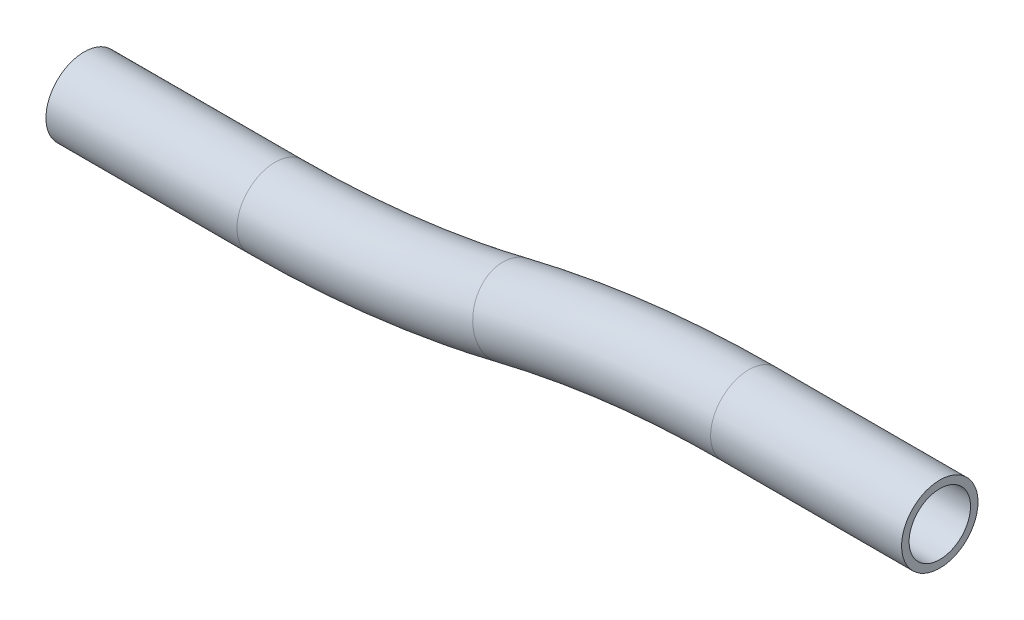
ISO-10303-21;
HEADER;
FILE_DESCRIPTION(('STEP AP214'),'2;1');
FILE_NAME('part.step','',(''),(''),'','','');
FILE_SCHEMA(('AUTOMOTIVE_DESIGN { 1 0 10303 214 1 1 1 1 }'));
ENDSEC;
DATA;
#1=APPLICATION_CONTEXT('core data for automotive mechanical design processes');
#2=APPLICATION_PROTOCOL_DEFINITION('international standard','automotive_design',2000,#1);
#3=PRODUCT_CONTEXT('',#1,'mechanical');
#4=PRODUCT('Part','Part','',(#3));
#5=PRODUCT_RELATED_PRODUCT_CATEGORY('part','',(#4));
#6=PRODUCT_DEFINITION_FORMATION('','',#4);
#7=PRODUCT_DEFINITION_CONTEXT('part definition',#1,'design');
#8=PRODUCT_DEFINITION('design','',#6,#7);
#9=PRODUCT_DEFINITION_SHAPE('','',#8);
#10=(LENGTH_UNIT() NAMED_UNIT(*) SI_UNIT(.MILLI.,.METRE.));
#11=(NAMED_UNIT(*) PLANE_ANGLE_UNIT() SI_UNIT($,.RADIAN.));
#12=(NAMED_UNIT(*) SI_UNIT($,.STERADIAN.) SOLID_ANGLE_UNIT());
#13=UNCERTAINTY_MEASURE_WITH_UNIT(LENGTH_MEASURE(1.E-05),#10,'distance_accuracy_value','');
#14=(GEOMETRIC_REPRESENTATION_CONTEXT(3) GLOBAL_UNCERTAINTY_ASSIGNED_CONTEXT((#13)) GLOBAL_UNIT_ASSIGNED_CONTEXT((#10,
#11,#12)) REPRESENTATION_CONTEXT('',''));
#15=CARTESIAN_POINT('',(0.,0.,0.));
#16=DIRECTION('',(0.,0.,1.));
#17=DIRECTION('',(1.,0.,0.));
#18=AXIS2_PLACEMENT_3D('',#15,#16,#17);
#19=CARTESIAN_POINT('',(110.49,9.4900533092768,0.));
#20=DIRECTION('',(1.,0.,0.));
#21=DIRECTION('',(0.,1.,0.));
#22=AXIS2_PLACEMENT_3D('',#19,#20,#21);
#23=CYLINDRICAL_SURFACE('',#22,6.35);
#24=CARTESIAN_POINT('',(110.49,9.4900533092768,0.));
#25=DIRECTION('',(1.,0.,0.));
#26=DIRECTION('',(0.,0.,-1.));
#27=AXIS2_PLACEMENT_3D('',#24,#25,#26);
#28=CIRCLE('',#27,6.35);
#29=CARTESIAN_POINT('',(110.49,15.8400533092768,0.));
#30=VERTEX_POINT('',#29);
#31=EDGE_CURVE('E39',#30,#30,#28,.T.);
#32=ORIENTED_EDGE('',*,*,#31,.T.);
#33=EDGE_LOOP('',(#32));
#34=FACE_BOUND('',#33,.T.);
#35=CARTESIAN_POINT('',(142.24,9.49005330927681,0.));
#36=DIRECTION('',(1.,0.,0.));
#37=DIRECTION('',(0.,0.,-1.));
#38=AXIS2_PLACEMENT_3D('',#35,#36,#37);
#39=CIRCLE('',#38,6.35);
#40=CARTESIAN_POINT('',(142.24,9.49005330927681,-6.35));
#41=VERTEX_POINT('',#40);
#42=EDGE_CURVE('E10',#41,#41,#39,.T.);
#43=ORIENTED_EDGE('',*,*,#42,.F.);
#44=EDGE_LOOP('',(#43));
#45=FACE_BOUND('',#44,.T.);
#46=ADVANCED_FACE('F29',(#34,#45),#23,.T.);
#47=CARTESIAN_POINT('',(110.49,9.4900533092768,0.));
#48=DIRECTION('',(1.,0.,0.));
#49=DIRECTION('',(0.,1.,0.));
#50=AXIS2_PLACEMENT_3D('',#47,#48,#49);
#51=CYLINDRICAL_SURFACE('',#50,5.1054);
#52=CARTESIAN_POINT('',(110.49,9.4900533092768,0.));
#53=DIRECTION('',(1.,0.,0.));
#54=DIRECTION('',(0.,0.,-1.));
#55=AXIS2_PLACEMENT_3D('',#52,#53,#54);
#56=CIRCLE('',#55,5.1054);
#57=CARTESIAN_POINT('',(110.49,14.5954533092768,0.));
#58=VERTEX_POINT('',#57);
#59=EDGE_CURVE('E43',#58,#58,#56,.T.);
#60=ORIENTED_EDGE('',*,*,#59,.F.);
#61=EDGE_LOOP('',(#60));
#62=FACE_BOUND('',#61,.T.);
#63=CARTESIAN_POINT('',(142.24,9.49005330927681,0.));
#64=DIRECTION('',(1.,0.,0.));
#65=DIRECTION('',(0.,0.,-1.));
#66=AXIS2_PLACEMENT_3D('',#63,#64,#65);
#67=CIRCLE('',#66,5.1054);
#68=CARTESIAN_POINT('',(142.24,9.49005330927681,-5.1054));
#69=VERTEX_POINT('',#68);
#70=EDGE_CURVE('E35',#69,#69,#67,.T.);
#71=ORIENTED_EDGE('',*,*,#70,.T.);
#72=EDGE_LOOP('',(#71));
#73=FACE_BOUND('',#72,.T.);
#74=ADVANCED_FACE('F84',(#62,#73),#51,.F.);
#75=CARTESIAN_POINT('',(110.49,-156.211036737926,0.));
#76=DIRECTION('',(0.,0.,-1.));
#77=DIRECTION('',(-1.,0.,0.));
#78=AXIS2_PLACEMENT_3D('',#75,#76,#77);
#79=TOROIDAL_SURFACE('',#78,165.701090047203,6.35);
#80=CARTESIAN_POINT('',(71.1199999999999,4.74502665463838,0.));
#81=DIRECTION('',(0.971363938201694,0.237596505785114,0.));
#82=DIRECTION('',(0.,0.,-1.));
#83=AXIS2_PLACEMENT_3D('',#80,#81,#82);
#84=CIRCLE('',#83,6.35);
#85=CARTESIAN_POINT('',(69.6112621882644,10.9131876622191,0.));
#86=VERTEX_POINT('',#85);
#87=EDGE_CURVE('E48',#86,#86,#84,.T.);
#88=CARTESIAN_POINT('',(110.49,-156.211036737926,0.));
#89=DIRECTION('',(0.,0.,-1.));
#90=DIRECTION('',(-1.,0.,0.));
#91=AXIS2_PLACEMENT_3D('',#88,#89,#90);
#92=CIRCLE('',#91,172.051090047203);
#93=EDGE_CURVE('',#86,#30,#92,.T.);
#94=ORIENTED_EDGE('',*,*,#87,.T.);
#95=ORIENTED_EDGE('',*,*,#31,.F.);
#96=ORIENTED_EDGE('',*,*,#93,.T.);
#97=ORIENTED_EDGE('',*,*,#93,.F.);
#98=EDGE_LOOP('',(#94,#96,#95,#97));
#99=FACE_BOUND('',#98,.T.);
#100=ADVANCED_FACE('F80',(#99),#79,.T.);
#101=CARTESIAN_POINT('',(110.49,-156.211036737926,0.));
#102=DIRECTION('',(0.,0.,-1.));
#103=DIRECTION('',(-1.,0.,0.));
#104=AXIS2_PLACEMENT_3D('',#101,#102,#103);
#105=TOROIDAL_SURFACE('',#104,165.701090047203,5.1054);
#106=CARTESIAN_POINT('',(71.1199999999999,4.74502665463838,0.));
#107=DIRECTION('',(0.971363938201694,0.237596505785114,0.));
#108=DIRECTION('',(0.,0.,-1.));
#109=AXIS2_PLACEMENT_3D('',#106,#107,#108);
#110=CIRCLE('',#109,5.1054);
#111=CARTESIAN_POINT('',(69.9069747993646,9.70422810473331,0.));
#112=VERTEX_POINT('',#111);
#113=EDGE_CURVE('E51',#112,#112,#110,.T.);
#114=CARTESIAN_POINT('',(110.49,-156.211036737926,0.));
#115=DIRECTION('',(0.,0.,-1.));
#116=DIRECTION('',(-1.,0.,0.));
#117=AXIS2_PLACEMENT_3D('',#114,#115,#116);
#118=CIRCLE('',#117,170.806490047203);
#119=EDGE_CURVE('',#112,#58,#118,.T.);
#120=ORIENTED_EDGE('',*,*,#113,.F.);
#121=ORIENTED_EDGE('',*,*,#59,.T.);
#122=ORIENTED_EDGE('',*,*,#119,.T.);
#123=ORIENTED_EDGE('',*,*,#119,.F.);
#124=EDGE_LOOP('',(#120,#122,#121,#123));
#125=FACE_BOUND('',#124,.T.);
#126=ADVANCED_FACE('F77',(#125),#105,.F.);
#127=CARTESIAN_POINT('',(31.75,165.701090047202,0.));
#128=DIRECTION('',(0.,0.,1.));
#129=DIRECTION('',(1.,0.,0.));
#130=AXIS2_PLACEMENT_3D('',#127,#128,#129);
#131=TOROIDAL_SURFACE('',#130,165.701090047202,6.35);
#132=CARTESIAN_POINT('',(31.75,0.,0.));
#133=DIRECTION('',(1.,0.,0.));
#134=DIRECTION('',(0.,0.,-1.));
#135=AXIS2_PLACEMENT_3D('',#132,#133,#134);
#136=CIRCLE('',#135,6.35);
#137=CARTESIAN_POINT('',(31.75,0.,-6.35));
#138=VERTEX_POINT('',#137);
#139=EDGE_CURVE('E54',#138,#138,#136,.T.);
#140=ORIENTED_EDGE('',*,*,#139,.T.);
#141=EDGE_LOOP('',(#140));
#142=FACE_BOUND('',#141,.T.);
#143=ORIENTED_EDGE('',*,*,#87,.F.);
#144=EDGE_LOOP('',(#143));
#145=FACE_BOUND('',#144,.T.);
#146=ADVANCED_FACE('F73',(#142,#145),#131,.T.);
#147=CARTESIAN_POINT('',(31.75,165.701090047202,0.));
#148=DIRECTION('',(0.,0.,1.));
#149=DIRECTION('',(1.,0.,0.));
#150=AXIS2_PLACEMENT_3D('',#147,#148,#149);
#151=TOROIDAL_SURFACE('',#150,165.701090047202,5.1054);
#152=CARTESIAN_POINT('',(31.75,0.,0.));
#153=DIRECTION('',(1.,0.,0.));
#154=DIRECTION('',(0.,0.,-1.));
#155=AXIS2_PLACEMENT_3D('',#152,#153,#154);
#156=CIRCLE('',#155,5.1054);
#157=CARTESIAN_POINT('',(31.75,0.,-5.1054));
#158=VERTEX_POINT('',#157);
#159=EDGE_CURVE('E58',#158,#158,#156,.T.);
#160=ORIENTED_EDGE('',*,*,#159,.F.);
#161=EDGE_LOOP('',(#160));
#162=FACE_BOUND('',#161,.T.);
#163=ORIENTED_EDGE('',*,*,#113,.T.);
#164=EDGE_LOOP('',(#163));
#165=FACE_BOUND('',#164,.T.);
#166=ADVANCED_FACE('F70',(#162,#165),#151,.F.);
#167=CARTESIAN_POINT('',(31.75,0.,0.));
#168=DIRECTION('',(-1.,0.,0.));
#169=DIRECTION('',(0.,0.,1.));
#170=AXIS2_PLACEMENT_3D('',#167,#168,#169);
#171=CYLINDRICAL_SURFACE('',#170,5.1054);
#172=ORIENTED_EDGE('',*,*,#159,.T.);
#173=EDGE_LOOP('',(#172));
#174=FACE_BOUND('',#173,.T.);
#175=CARTESIAN_POINT('',(0.,0.,0.));
#176=DIRECTION('',(1.,0.,0.));
#177=DIRECTION('',(0.,0.,-1.));
#178=AXIS2_PLACEMENT_3D('',#175,#176,#177);
#179=CIRCLE('',#178,5.1054);
#180=CARTESIAN_POINT('',(0.,0.,-5.1054));
#181=VERTEX_POINT('',#180);
#182=EDGE_CURVE('E59',#181,#181,#179,.T.);
#183=ORIENTED_EDGE('',*,*,#182,.F.);
#184=EDGE_LOOP('',(#183));
#185=FACE_BOUND('',#184,.T.);
#186=ADVANCED_FACE('F67',(#174,#185),#171,.F.);
#187=CARTESIAN_POINT('',(31.75,0.,0.));
#188=DIRECTION('',(-1.,0.,0.));
#189=DIRECTION('',(0.,0.,1.));
#190=AXIS2_PLACEMENT_3D('',#187,#188,#189);
#191=CYLINDRICAL_SURFACE('',#190,6.35);
#192=ORIENTED_EDGE('',*,*,#139,.F.);
#193=EDGE_LOOP('',(#192));
#194=FACE_BOUND('',#193,.T.);
#195=CARTESIAN_POINT('',(0.,0.,0.));
#196=DIRECTION('',(1.,0.,0.));
#197=DIRECTION('',(0.,0.,-1.));
#198=AXIS2_PLACEMENT_3D('',#195,#196,#197);
#199=CIRCLE('',#198,6.35);
#200=CARTESIAN_POINT('',(0.,0.,-6.35));
#201=VERTEX_POINT('',#200);
#202=EDGE_CURVE('E55',#201,#201,#199,.T.);
#203=ORIENTED_EDGE('',*,*,#202,.T.);
#204=EDGE_LOOP('',(#203));
#205=FACE_BOUND('',#204,.T.);
#206=ADVANCED_FACE('F99',(#194,#205),#191,.T.);
#207=CARTESIAN_POINT('',(142.24,9.49005330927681,0.));
#208=DIRECTION('',(1.,0.,0.));
#209=DIRECTION('',(0.,0.,-1.));
#210=AXIS2_PLACEMENT_3D('',#207,#208,#209);
#211=PLANE('',#210);
#212=ORIENTED_EDGE('',*,*,#70,.F.);
#213=EDGE_LOOP('',(#212));
#214=FACE_BOUND('',#213,.T.);
#215=ORIENTED_EDGE('',*,*,#42,.T.);
#216=EDGE_LOOP('',(#215));
#217=FACE_BOUND('',#216,.T.);
#218=ADVANCED_FACE('F102',(#214,#217),#211,.T.);
#219=CARTESIAN_POINT('',(0.,0.,0.));
#220=DIRECTION('',(1.,0.,0.));
#221=DIRECTION('',(0.,0.,-1.));
#222=AXIS2_PLACEMENT_3D('',#219,#220,#221);
#223=PLANE('',#222);
#224=ORIENTED_EDGE('',*,*,#182,.T.);
#225=EDGE_LOOP('',(#224));
#226=FACE_BOUND('',#225,.T.);
#227=ORIENTED_EDGE('',*,*,#202,.F.);
#228=EDGE_LOOP('',(#227));
#229=FACE_BOUND('',#228,.T.);
#230=ADVANCED_FACE('F104',(#226,#229),#223,.F.);
#231=CLOSED_SHELL('',(#46,#74,#100,#126,#146,#166,#186,#206,#218,#230));
#232=MANIFOLD_SOLID_BREP('B2',#231);
#233=ADVANCED_BREP_SHAPE_REPRESENTATION('',(#18,#232),#14);
#234=SHAPE_DEFINITION_REPRESENTATION(#9,#233);
ENDSEC;
END-ISO-10303-21;
